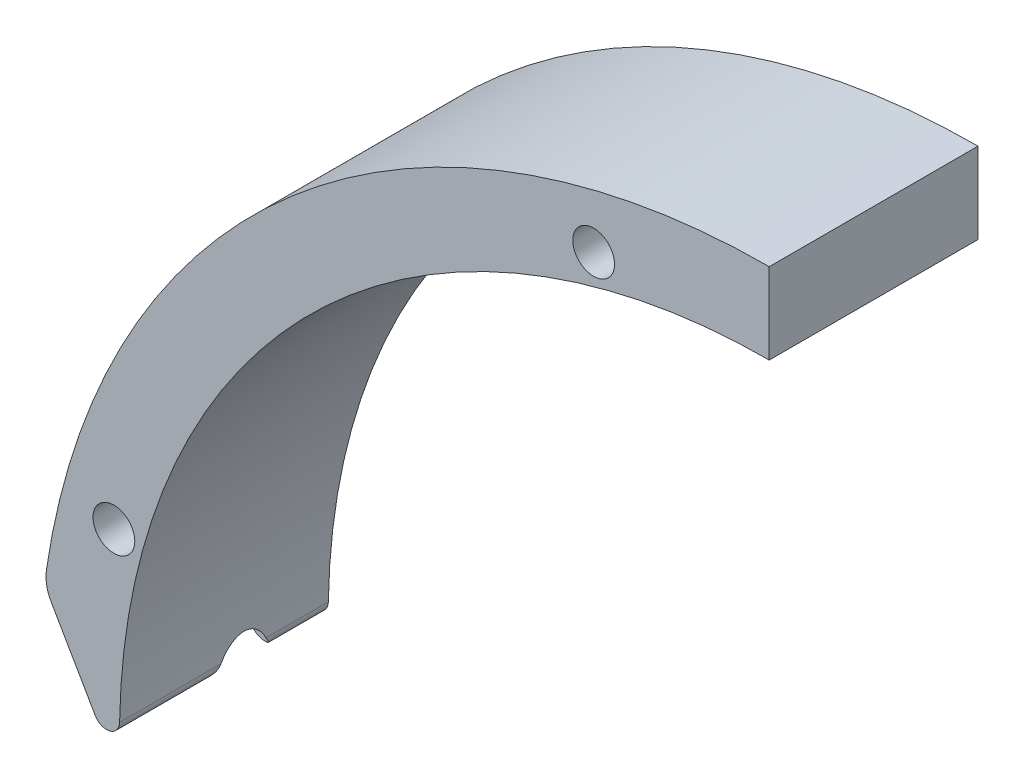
ISO-10303-21;
HEADER;
FILE_DESCRIPTION(('STEP AP214'),'2;1');
FILE_NAME('part.step','',(''),(''),'','','');
FILE_SCHEMA(('AUTOMOTIVE_DESIGN { 1 0 10303 214 1 1 1 1 }'));
ENDSEC;
DATA;
#1=APPLICATION_CONTEXT('core data for automotive mechanical design processes');
#2=APPLICATION_PROTOCOL_DEFINITION('international standard','automotive_design',2000,#1);
#3=PRODUCT_CONTEXT('',#1,'mechanical');
#4=PRODUCT('Part','Part','',(#3));
#5=PRODUCT_RELATED_PRODUCT_CATEGORY('part','',(#4));
#6=PRODUCT_DEFINITION_FORMATION('','',#4);
#7=PRODUCT_DEFINITION_CONTEXT('part definition',#1,'design');
#8=PRODUCT_DEFINITION('design','',#6,#7);
#9=PRODUCT_DEFINITION_SHAPE('','',#8);
#10=(LENGTH_UNIT() NAMED_UNIT(*) SI_UNIT(.MILLI.,.METRE.));
#11=(NAMED_UNIT(*) PLANE_ANGLE_UNIT() SI_UNIT($,.RADIAN.));
#12=(NAMED_UNIT(*) SI_UNIT($,.STERADIAN.) SOLID_ANGLE_UNIT());
#13=UNCERTAINTY_MEASURE_WITH_UNIT(LENGTH_MEASURE(1.E-05),#10,'distance_accuracy_value','');
#14=(GEOMETRIC_REPRESENTATION_CONTEXT(3) GLOBAL_UNCERTAINTY_ASSIGNED_CONTEXT((#13)) GLOBAL_UNIT_ASSIGNED_CONTEXT((#10,
#11,#12)) REPRESENTATION_CONTEXT('',''));
#15=CARTESIAN_POINT('',(0.,0.,0.));
#16=DIRECTION('',(0.,0.,1.));
#17=DIRECTION('',(1.,0.,0.));
#18=AXIS2_PLACEMENT_3D('',#15,#16,#17);
#19=CARTESIAN_POINT('',(-76.8299167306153,43.9738419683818,-4.25404090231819));
#20=DIRECTION('',(0.86602540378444,0.499999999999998,0.));
#21=DIRECTION('',(-0.499999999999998,0.86602540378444,0.));
#22=AXIS2_PLACEMENT_3D('',#19,#20,#21);
#23=PLANE('',#22);
#24=DIRECTION('',(-0.499999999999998,0.86602540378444,0.));
#25=VECTOR('',#24,1.);
#26=CARTESIAN_POINT('',(-76.8299167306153,43.9738419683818,4.));
#27=LINE('',#26,#25);
#28=CARTESIAN_POINT('',(-51.6584782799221,0.375631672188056,4.));
#29=VERTEX_POINT('',#28);
#30=CARTESIAN_POINT('',(-55.0327951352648,6.22011990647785,4.));
#31=VERTEX_POINT('',#30);
#32=EDGE_CURVE('E168',#29,#31,#27,.T.);
#33=ORIENTED_EDGE('',*,*,#32,.T.);
#34=DIRECTION('',(0.,0.,-1.));
#35=VECTOR('',#34,1.);
#36=CARTESIAN_POINT('',(-55.0327951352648,6.22011990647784,-4.25404090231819));
#37=LINE('',#36,#35);
#38=CARTESIAN_POINT('',(-55.0327951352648,6.22011990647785,0.));
#39=VERTEX_POINT('',#38);
#40=EDGE_CURVE('E44',#31,#39,#37,.T.);
#41=ORIENTED_EDGE('',*,*,#40,.T.);
#42=DIRECTION('',(-0.499999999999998,0.86602540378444,0.));
#43=VECTOR('',#42,1.);
#44=CARTESIAN_POINT('',(-38.5812054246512,-22.2748693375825,0.));
#45=LINE('',#44,#43);
#46=CARTESIAN_POINT('',(-51.6584782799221,0.375631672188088,0.));
#47=VERTEX_POINT('',#46);
#48=EDGE_CURVE('E261',#47,#39,#45,.T.);
#49=ORIENTED_EDGE('',*,*,#48,.F.);
#50=DIRECTION('',(0.,0.,-1.));
#51=VECTOR('',#50,1.);
#52=CARTESIAN_POINT('',(-51.6584782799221,0.375631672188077,-4.25404090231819));
#53=LINE('',#52,#51);
#54=EDGE_CURVE('E288',#47,#29,#53,.F.);
#55=ORIENTED_EDGE('',*,*,#54,.T.);
#56=EDGE_LOOP('',(#33,#41,#49,#55));
#57=FACE_BOUND('',#56,.T.);
#58=ADVANCED_FACE('F35',(#57),#23,.F.);
#59=CARTESIAN_POINT('',(0.,0.,16.));
#60=DIRECTION('',(0.,0.,-1.));
#61=DIRECTION('',(-1.,0.,0.));
#62=AXIS2_PLACEMENT_3D('',#59,#60,#61);
#63=CYLINDRICAL_SURFACE('',#62,56.);
#64=CARTESIAN_POINT('',(-55.5362921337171,7.19167963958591,4.));
#65=CARTESIAN_POINT('',(-55.5250639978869,7.27838837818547,4.00000361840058));
#66=CARTESIAN_POINT('',(-55.5136332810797,7.36506300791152,4.00169020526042));
#67=CARTESIAN_POINT('',(-55.4903830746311,7.53823705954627,4.00851878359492));
#68=CARTESIAN_POINT('',(-55.4785635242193,7.62473645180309,4.01366131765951));
#69=CARTESIAN_POINT('',(-55.4424737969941,7.88433003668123,4.03445113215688));
#70=CARTESIAN_POINT('',(-55.4176455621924,8.05695595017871,4.05546183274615));
#71=CARTESIAN_POINT('',(-55.3664122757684,8.40185733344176,4.11317259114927));
#72=CARTESIAN_POINT('',(-55.3399901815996,8.57409503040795,4.15008534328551));
#73=CARTESIAN_POINT('',(-55.2863162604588,8.9136241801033,4.24105722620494));
#74=CARTESIAN_POINT('',(-55.2590658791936,9.08092334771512,4.29508787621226));
#75=CARTESIAN_POINT('',(-55.2045566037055,9.40658894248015,4.42163953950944));
#76=CARTESIAN_POINT('',(-55.1773003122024,9.56502580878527,4.49397771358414));
#77=CARTESIAN_POINT('',(-55.1234983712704,9.87034942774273,4.65948516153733));
#78=CARTESIAN_POINT('',(-55.0969506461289,10.0172731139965,4.75258380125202));
#79=CARTESIAN_POINT('',(-55.0509052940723,10.266971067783,4.94156780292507));
#80=CARTESIAN_POINT('',(-55.0310443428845,10.3727598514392,5.03334647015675));
#81=CARTESIAN_POINT('',(-54.9937500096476,10.5686973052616,5.23287606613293));
#82=CARTESIAN_POINT('',(-54.9763134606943,10.6588664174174,5.34060577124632));
#83=CARTESIAN_POINT('',(-54.9491547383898,10.7978764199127,5.54303670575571));
#84=CARTESIAN_POINT('',(-54.9385910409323,10.8514237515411,5.63437723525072));
#85=CARTESIAN_POINT('',(-54.9203814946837,10.9432121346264,5.82477389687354));
#86=CARTESIAN_POINT('',(-54.9127335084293,10.981464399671,5.92382431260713));
#87=CARTESIAN_POINT('',(-54.9009787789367,11.0400840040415,6.12818893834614));
#88=CARTESIAN_POINT('',(-54.8968991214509,11.0603145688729,6.23354468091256));
#89=CARTESIAN_POINT('',(-54.8928218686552,11.080533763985,6.44625609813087));
#90=CARTESIAN_POINT('',(-54.89282207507,11.0805332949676,6.55361066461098));
#91=CARTESIAN_POINT('',(-54.8966574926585,11.06151231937,6.75397691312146));
#92=CARTESIAN_POINT('',(-54.900050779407,11.0446835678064,6.84721583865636));
#93=CARTESIAN_POINT('',(-54.9097311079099,10.9964552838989,7.02965805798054));
#94=CARTESIAN_POINT('',(-54.9160187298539,10.9650528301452,7.11886053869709));
#95=CARTESIAN_POINT('',(-54.9313246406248,10.8881198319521,7.29479821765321));
#96=CARTESIAN_POINT('',(-54.940439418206,10.8420883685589,7.38130337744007));
#97=CARTESIAN_POINT('',(-54.9607309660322,10.738753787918,7.54697089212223));
#98=CARTESIAN_POINT('',(-54.9719087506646,10.6814451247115,7.62612960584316));
#99=CARTESIAN_POINT('',(-55.0029505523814,10.5207170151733,7.82183452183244));
#100=CARTESIAN_POINT('',(-55.0240087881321,10.4102311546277,7.93239517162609));
#101=CARTESIAN_POINT('',(-55.0683069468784,10.1733063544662,8.13439297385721));
#102=CARTESIAN_POINT('',(-55.0915523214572,10.0468272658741,8.22578040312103));
#103=CARTESIAN_POINT('',(-55.1330335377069,9.81624824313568,8.37012331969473));
#104=CARTESIAN_POINT('',(-55.1510633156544,9.71449311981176,8.42696886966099));
#105=CARTESIAN_POINT('',(-55.1873185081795,9.50636785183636,8.53150143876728));
#106=CARTESIAN_POINT('',(-55.2055440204,9.39999531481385,8.57918363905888));
#107=CARTESIAN_POINT('',(-55.2419620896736,9.18355639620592,8.66614894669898));
#108=CARTESIAN_POINT('',(-55.2601544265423,9.07348085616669,8.70540913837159));
#109=CARTESIAN_POINT('',(-55.296263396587,8.85076189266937,8.77598499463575));
#110=CARTESIAN_POINT('',(-55.314179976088,8.73811797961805,8.80729913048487));
#111=CARTESIAN_POINT('',(-55.350202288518,8.50701217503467,8.8634533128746));
#112=CARTESIAN_POINT('',(-55.3682928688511,8.38848430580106,8.88802983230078));
#113=CARTESIAN_POINT('',(-55.4038959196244,8.15002200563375,8.92969737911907));
#114=CARTESIAN_POINT('',(-55.4214082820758,8.0300873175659,8.94678701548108));
#115=CARTESIAN_POINT('',(-55.4555765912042,7.79060254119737,8.97371612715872));
#116=CARTESIAN_POINT('',(-55.4722396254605,7.67106175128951,8.98363021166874));
#117=CARTESIAN_POINT('',(-55.504830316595,7.43158526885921,8.99676296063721));
#118=CARTESIAN_POINT('',(-55.5207584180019,7.31164986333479,8.99998572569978));
#119=CARTESIAN_POINT('',(-55.5362921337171,7.1916796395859,9.));
#120=B_SPLINE_CURVE_WITH_KNOTS('',3,(#64,#65,#66,#67,#68,#69,#70,#71,#72,#73,#74,#75,#76,#77,
#78,#79,#80,#81,#82,#83,#84,#85,#86,#87,#88,#89,#90,#91,#92,#93,#94,#95,#96,#97,#98,#99,#100,
#101,#102,#103,#104,#105,#106,#107,#108,#109,#110,#111,#112,#113,#114,#115,#116,#117,#118,#119),
.UNSPECIFIED.,.F.,.F.,(4,2,2,2,2,2,2,2,2,2,2,2,2,2,2,2,2,2,2,2,2,2,2,2,2,2,2,4),(0.,
0.262264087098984,0.524569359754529,1.05088011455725,1.58446031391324,2.11715736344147,
2.64473091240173,3.17053614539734,3.59349766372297,4.01590138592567,4.33390570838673,
4.65167645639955,4.97183884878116,5.29182873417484,5.57494500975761,5.85811806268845,
6.1522788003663,6.44658456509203,6.91706892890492,7.38875874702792,7.74212708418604,
8.09568074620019,8.45018453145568,8.80475646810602,9.17168005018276,9.53867177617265,
9.90179056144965,10.2646867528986),.UNSPECIFIED.);
#121=CARTESIAN_POINT('',(-55.4027218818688,8.1571078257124,4.07267014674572));
#122=VERTEX_POINT('',#121);
#123=CARTESIAN_POINT('',(-55.4027218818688,8.15710782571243,8.92732985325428));
#124=VERTEX_POINT('',#123);
#125=EDGE_CURVE('E199',#122,#124,#120,.T.);
#126=ORIENTED_EDGE('',*,*,#125,.T.);
#127=DIRECTION('',(0.,0.,-1.));
#128=VECTOR('',#127,1.);
#129=CARTESIAN_POINT('',(-55.4027218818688,8.15710782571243,16.));
#130=LINE('',#129,#128);
#131=CARTESIAN_POINT('',(-55.4027218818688,8.15710782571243,16.));
#132=VERTEX_POINT('',#131);
#133=EDGE_CURVE('E258',#124,#132,#130,.F.);
#134=ORIENTED_EDGE('',*,*,#133,.T.);
#135=CARTESIAN_POINT('',(0.,0.,16.));
#136=DIRECTION('',(0.,0.,1.));
#137=DIRECTION('',(1.,0.,0.));
#138=AXIS2_PLACEMENT_3D('',#135,#136,#137);
#139=CIRCLE('',#138,56.);
#140=CARTESIAN_POINT('',(0.,56.,16.));
#141=VERTEX_POINT('',#140);
#142=EDGE_CURVE('E139',#141,#132,#139,.T.);
#143=ORIENTED_EDGE('',*,*,#142,.F.);
#144=DIRECTION('',(0.,0.,-1.));
#145=VECTOR('',#144,1.);
#146=CARTESIAN_POINT('',(0.,56.,16.));
#147=LINE('',#146,#145);
#148=CARTESIAN_POINT('',(0.,56.,0.));
#149=VERTEX_POINT('',#148);
#150=EDGE_CURVE('E151',#141,#149,#147,.T.);
#151=ORIENTED_EDGE('',*,*,#150,.T.);
#152=CARTESIAN_POINT('',(0.,0.,0.));
#153=DIRECTION('',(0.,0.,1.));
#154=DIRECTION('',(1.,0.,0.));
#155=AXIS2_PLACEMENT_3D('',#152,#153,#154);
#156=CIRCLE('',#155,56.);
#157=CARTESIAN_POINT('',(-55.4027218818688,8.15710782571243,0.));
#158=VERTEX_POINT('',#157);
#159=EDGE_CURVE('E160',#149,#158,#156,.T.);
#160=ORIENTED_EDGE('',*,*,#159,.T.);
#161=DIRECTION('',(0.,0.,-1.));
#162=VECTOR('',#161,1.);
#163=CARTESIAN_POINT('',(-55.4027218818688,8.15710782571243,16.));
#164=LINE('',#163,#162);
#165=EDGE_CURVE('E260',#158,#122,#164,.F.);
#166=ORIENTED_EDGE('',*,*,#165,.T.);
#167=EDGE_LOOP('',(#126,#134,#143,#151,#160,#166));
#168=FACE_BOUND('',#167,.T.);
#169=ADVANCED_FACE('F245',(#168),#63,.T.);
#170=CARTESIAN_POINT('',(0.,0.,16.));
#171=DIRECTION('',(0.,0.,-1.));
#172=DIRECTION('',(-1.,0.,0.));
#173=AXIS2_PLACEMENT_3D('',#170,#171,#172);
#174=CYLINDRICAL_SURFACE('',#173,49.8);
#175=CARTESIAN_POINT('',(-49.7161222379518,-2.88915032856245,9.));
#176=CARTESIAN_POINT('',(-49.7236886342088,-2.75896416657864,8.9999906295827));
#177=CARTESIAN_POINT('',(-49.7307424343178,-2.62873922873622,8.99794308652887));
#178=CARTESIAN_POINT('',(-49.7438229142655,-2.36834479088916,8.9895125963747));
#179=CARTESIAN_POINT('',(-49.7498493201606,-2.23817531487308,8.98312849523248));
#180=CARTESIAN_POINT('',(-49.7609087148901,-1.97715816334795,8.9657030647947));
#181=CARTESIAN_POINT('',(-49.7659342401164,-1.84631235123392,8.95462854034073));
#182=CARTESIAN_POINT('',(-49.774938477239,-1.58510990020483,8.92747884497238));
#183=CARTESIAN_POINT('',(-49.7789172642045,-1.45475322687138,8.91140403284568));
#184=CARTESIAN_POINT('',(-49.7860667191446,-1.18608748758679,8.87258588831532));
#185=CARTESIAN_POINT('',(-49.7891655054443,-1.0478299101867,8.84946833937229));
#186=CARTESIAN_POINT('',(-49.7941967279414,-0.772600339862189,8.7964612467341));
#187=CARTESIAN_POINT('',(-49.796129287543,-0.63562821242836,8.76657242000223));
#188=CARTESIAN_POINT('',(-49.7988551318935,-0.363911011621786,8.69935419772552));
#189=CARTESIAN_POINT('',(-49.7996516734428,-0.22916067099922,8.66204642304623));
#190=CARTESIAN_POINT('',(-49.8001642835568,0.0376891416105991,8.57900793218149));
#191=CARTESIAN_POINT('',(-49.7998808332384,0.169789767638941,8.53328097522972));
#192=CARTESIAN_POINT('',(-49.7984046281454,0.414822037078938,8.43820689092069));
#193=CARTESIAN_POINT('',(-49.7973237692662,0.528168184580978,8.38993327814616));
#194=CARTESIAN_POINT('',(-49.7944620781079,0.750968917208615,8.28486700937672));
#195=CARTESIAN_POINT('',(-49.7926808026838,0.860420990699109,8.22806897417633));
#196=CARTESIAN_POINT('',(-49.7885675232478,1.07218978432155,8.10567301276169));
#197=CARTESIAN_POINT('',(-49.7862440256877,1.17458791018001,8.04021716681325));
#198=CARTESIAN_POINT('',(-49.7812051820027,1.37159715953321,7.89861666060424));
#199=CARTESIAN_POINT('',(-49.7784904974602,1.46622101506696,7.82249005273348));
#200=CARTESIAN_POINT('',(-49.7735189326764,1.62534355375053,7.67571067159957));
#201=CARTESIAN_POINT('',(-49.7712882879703,1.69195733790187,7.6073683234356));
#202=CARTESIAN_POINT('',(-49.7669139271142,1.81607626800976,7.4625863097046));
#203=CARTESIAN_POINT('',(-49.7647703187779,1.87357035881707,7.38613700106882));
#204=CARTESIAN_POINT('',(-49.7607783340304,1.97677583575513,7.22438849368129));
#205=CARTESIAN_POINT('',(-49.7589332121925,2.02236028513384,7.13900654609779));
#206=CARTESIAN_POINT('',(-49.7558383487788,2.09713496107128,6.9613125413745));
#207=CARTESIAN_POINT('',(-49.7545876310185,2.126352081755,6.86901213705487));
#208=CARTESIAN_POINT('',(-49.752970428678,2.16385640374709,6.68666037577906));
#209=CARTESIAN_POINT('',(-49.7525499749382,2.17342282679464,6.5968774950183));
#210=CARTESIAN_POINT('',(-49.7525093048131,2.17435565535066,6.41722963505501));
#211=CARTESIAN_POINT('',(-49.7528887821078,2.16572902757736,6.32736470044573));
#212=CARTESIAN_POINT('',(-49.754261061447,2.13393901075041,6.16435115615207));
#213=CARTESIAN_POINT('',(-49.7551532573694,2.11315186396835,6.09071803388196));
#214=CARTESIAN_POINT('',(-49.757349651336,2.0607869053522,5.9474398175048));
#215=CARTESIAN_POINT('',(-49.7586539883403,2.02920545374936,5.87779607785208));
#216=CARTESIAN_POINT('',(-49.7622244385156,1.94005513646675,5.71164552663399));
#217=CARTESIAN_POINT('',(-49.7646540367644,1.87725446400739,5.61795865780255));
#218=CARTESIAN_POINT('',(-49.7697248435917,1.73763431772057,5.441677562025));
#219=CARTESIAN_POINT('',(-49.7723665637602,1.6607803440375,5.35911152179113));
#220=CARTESIAN_POINT('',(-49.7770347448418,1.51364197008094,5.22002854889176));
#221=CARTESIAN_POINT('',(-49.7790784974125,1.44512281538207,5.16160588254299));
#222=CARTESIAN_POINT('',(-49.7829950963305,1.30324064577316,5.0509120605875));
#223=CARTESIAN_POINT('',(-49.7848678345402,1.2298746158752,4.99864479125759));
#224=CARTESIAN_POINT('',(-49.7883586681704,1.07935985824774,4.89966589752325));
#225=CARTESIAN_POINT('',(-49.7899763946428,1.00220585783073,4.85296234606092));
#226=CARTESIAN_POINT('',(-49.7928924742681,0.845015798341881,4.7646502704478));
#227=CARTESIAN_POINT('',(-49.7941907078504,0.764978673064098,4.72304365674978));
#228=CARTESIAN_POINT('',(-49.7973508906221,0.53478861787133,4.61158126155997));
#229=CARTESIAN_POINT('',(-49.7987764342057,0.381970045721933,4.54719665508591));
#230=CARTESIAN_POINT('',(-49.8001916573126,0.0714119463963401,4.4315524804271));
#231=CARTESIAN_POINT('',(-49.8001800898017,-0.086331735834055,4.38030434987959));
#232=CARTESIAN_POINT('',(-49.7986055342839,-0.405504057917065,4.28899348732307));
#233=CARTESIAN_POINT('',(-49.7970377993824,-0.566942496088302,4.24896545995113));
#234=CARTESIAN_POINT('',(-49.7922784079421,-0.891857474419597,4.1788853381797));
#235=CARTESIAN_POINT('',(-49.789087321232,-1.05533327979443,4.14882974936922));
#236=CARTESIAN_POINT('',(-49.7816670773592,-1.35827537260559,4.1015289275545));
#237=CARTESIAN_POINT('',(-49.7776740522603,-1.49755444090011,4.0830226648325));
#238=CARTESIAN_POINT('',(-49.7684915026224,-1.77672766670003,4.05181730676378));
#239=CARTESIAN_POINT('',(-49.7633018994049,-1.91662186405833,4.03911859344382));
#240=CARTESIAN_POINT('',(-49.7517844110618,-2.19526325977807,4.0192043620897));
#241=CARTESIAN_POINT('',(-49.7454690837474,-2.3340070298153,4.01193252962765));
#242=CARTESIAN_POINT('',(-49.7316705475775,-2.61156581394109,4.00233721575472));
#243=CARTESIAN_POINT('',(-49.7241877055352,-2.75038079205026,4.00001218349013));
#244=CARTESIAN_POINT('',(-49.7161222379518,-2.88915032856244,4.));
#245=B_SPLINE_CURVE_WITH_KNOTS('',3,(#175,#176,#177,#178,#179,#180,#181,#182,#183,#184,#185,
#186,#187,#188,#189,#190,#191,#192,#193,#194,#195,#196,#197,#198,#199,#200,#201,#202,#203,#204,
#205,#206,#207,#208,#209,#210,#211,#212,#213,#214,#215,#216,#217,#218,#219,#220,#221,#222,#223,
#224,#225,#226,#227,#228,#229,#230,#231,#232,#233,#234,#235,#236,#237,#238,#239,#240,#241,#242,
#243,#244),.UNSPECIFIED.,.F.,.F.,(4,2,2,2,2,2,2,2,2,2,2,2,2,2,2,2,2,2,2,2,2,2,2,2,2,2,2,2,2,2,2,
2,2,2,4),(0.,0.391213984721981,0.782532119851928,1.17666723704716,1.57077408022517,
1.99124990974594,2.41168123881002,2.83090481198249,3.24994165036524,3.61925266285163,
3.9887977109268,4.35289462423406,4.71638284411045,5.00214452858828,5.28825001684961,
5.57729081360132,5.86585526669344,6.13494887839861,6.40393946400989,6.63255587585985,
6.86124945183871,7.19779104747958,7.53517019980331,7.80500376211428,8.07500678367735,
8.34539692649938,8.61588810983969,9.11256741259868,9.60967770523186,10.108309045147,
10.6067654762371,11.0283143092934,11.4498908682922,11.8670294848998,12.2840373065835),.UNSPECIFIED.);
#246=CARTESIAN_POINT('',(-49.792601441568,0.858394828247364,8.22707858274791));
#247=VERTEX_POINT('',#246);
#248=CARTESIAN_POINT('',(-49.792601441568,0.858394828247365,4.77292141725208));
#249=VERTEX_POINT('',#248);
#250=EDGE_CURVE('E170',#247,#249,#245,.T.);
#251=ORIENTED_EDGE('',*,*,#250,.T.);
#252=DIRECTION('',(0.,0.,-1.));
#253=VECTOR('',#252,1.);
#254=CARTESIAN_POINT('',(-49.792601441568,0.858394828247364,16.));
#255=LINE('',#254,#253);
#256=CARTESIAN_POINT('',(-49.792601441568,0.858394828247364,0.));
#257=VERTEX_POINT('',#256);
#258=EDGE_CURVE('E290',#249,#257,#255,.T.);
#259=ORIENTED_EDGE('',*,*,#258,.T.);
#260=CARTESIAN_POINT('',(0.,0.,0.));
#261=DIRECTION('',(0.,0.,-1.));
#262=DIRECTION('',(1.,0.,0.));
#263=AXIS2_PLACEMENT_3D('',#260,#261,#262);
#264=CIRCLE('',#263,49.8);
#265=CARTESIAN_POINT('',(0.,49.8,0.));
#266=VERTEX_POINT('',#265);
#267=EDGE_CURVE('E147',#257,#266,#264,.T.);
#268=ORIENTED_EDGE('',*,*,#267,.T.);
#269=DIRECTION('',(0.,0.,-1.));
#270=VECTOR('',#269,1.);
#271=CARTESIAN_POINT('',(0.,49.8,16.));
#272=LINE('',#271,#270);
#273=CARTESIAN_POINT('',(0.,49.8,16.));
#274=VERTEX_POINT('',#273);
#275=EDGE_CURVE('E142',#274,#266,#272,.T.);
#276=ORIENTED_EDGE('',*,*,#275,.F.);
#277=CARTESIAN_POINT('',(0.,0.,16.));
#278=DIRECTION('',(0.,0.,-1.));
#279=DIRECTION('',(1.,0.,0.));
#280=AXIS2_PLACEMENT_3D('',#277,#278,#279);
#281=CIRCLE('',#280,49.8);
#282=CARTESIAN_POINT('',(-49.792601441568,0.858394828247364,16.));
#283=VERTEX_POINT('',#282);
#284=EDGE_CURVE('E125',#283,#274,#281,.T.);
#285=ORIENTED_EDGE('',*,*,#284,.F.);
#286=DIRECTION('',(0.,0.,-1.));
#287=VECTOR('',#286,1.);
#288=CARTESIAN_POINT('',(-49.792601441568,0.858394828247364,16.));
#289=LINE('',#288,#287);
#290=EDGE_CURVE('E177',#283,#247,#289,.T.);
#291=ORIENTED_EDGE('',*,*,#290,.T.);
#292=EDGE_LOOP('',(#251,#259,#268,#276,#285,#291));
#293=FACE_BOUND('',#292,.T.);
#294=ADVANCED_FACE('F144',(#293),#174,.F.);
#295=CARTESIAN_POINT('',(0.,56.,16.));
#296=DIRECTION('',(-1.,0.,0.));
#297=DIRECTION('',(0.,-1.,0.));
#298=AXIS2_PLACEMENT_3D('',#295,#296,#297);
#299=PLANE('',#298);
#300=DIRECTION('',(0.,1.,0.));
#301=VECTOR('',#300,1.);
#302=CARTESIAN_POINT('',(0.,56.,0.));
#303=LINE('',#302,#301);
#304=EDGE_CURVE('E165',#266,#149,#303,.T.);
#305=ORIENTED_EDGE('',*,*,#304,.T.);
#306=ORIENTED_EDGE('',*,*,#150,.F.);
#307=DIRECTION('',(0.,1.,0.));
#308=VECTOR('',#307,1.);
#309=CARTESIAN_POINT('',(0.,56.,16.));
#310=LINE('',#309,#308);
#311=EDGE_CURVE('E131',#274,#141,#310,.T.);
#312=ORIENTED_EDGE('',*,*,#311,.F.);
#313=ORIENTED_EDGE('',*,*,#275,.T.);
#314=EDGE_LOOP('',(#305,#306,#312,#313));
#315=FACE_BOUND('',#314,.T.);
#316=ADVANCED_FACE('F153',(#315),#299,.F.);
#317=CARTESIAN_POINT('',(0.,0.,16.));
#318=DIRECTION('',(0.,0.,1.));
#319=DIRECTION('',(1.,0.,0.));
#320=AXIS2_PLACEMENT_3D('',#317,#318,#319);
#321=PLANE('',#320);
#322=ORIENTED_EDGE('',*,*,#142,.T.);
#323=CARTESIAN_POINT('',(-52.4347189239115,7.72011990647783,16.));
#324=DIRECTION('',(0.,0.,1.));
#325=DIRECTION('',(1.,0.,0.));
#326=AXIS2_PLACEMENT_3D('',#323,#324,#325);
#327=CIRCLE('',#326,3.);
#328=CARTESIAN_POINT('',(-55.0327951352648,6.22011990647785,16.));
#329=VERTEX_POINT('',#328);
#330=EDGE_CURVE('E266',#132,#329,#327,.T.);
#331=ORIENTED_EDGE('',*,*,#330,.T.);
#332=DIRECTION('',(-0.499999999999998,0.86602540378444,0.));
#333=VECTOR('',#332,1.);
#334=CARTESIAN_POINT('',(-38.5812054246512,-22.2748693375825,16.));
#335=LINE('',#334,#333);
#336=CARTESIAN_POINT('',(-51.6584782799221,0.375631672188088,16.));
#337=VERTEX_POINT('',#336);
#338=EDGE_CURVE('E295',#337,#329,#335,.T.);
#339=ORIENTED_EDGE('',*,*,#338,.F.);
#340=CARTESIAN_POINT('',(-50.7924528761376,0.875631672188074,16.));
#341=DIRECTION('',(0.,0.,1.));
#342=DIRECTION('',(1.,0.,0.));
#343=AXIS2_PLACEMENT_3D('',#340,#341,#342);
#344=CIRCLE('',#343,1.);
#345=EDGE_CURVE('E135',#337,#283,#344,.T.);
#346=ORIENTED_EDGE('',*,*,#345,.T.);
#347=ORIENTED_EDGE('',*,*,#284,.T.);
#348=ORIENTED_EDGE('',*,*,#311,.T.);
#349=EDGE_LOOP('',(#322,#331,#339,#346,#347,#348));
#350=FACE_BOUND('',#349,.T.);
#351=CARTESIAN_POINT('',(-13.4585903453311,50.2281429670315,16.));
#352=DIRECTION('',(0.,0.,1.));
#353=DIRECTION('',(1.,0.,0.));
#354=AXIS2_PLACEMENT_3D('',#351,#352,#353);
#355=CIRCLE('',#354,1.59999999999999);
#356=CARTESIAN_POINT('',(-11.8585903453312,50.2281429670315,16.));
#357=VERTEX_POINT('',#356);
#358=EDGE_CURVE('E296',#357,#357,#355,.T.);
#359=ORIENTED_EDGE('',*,*,#358,.F.);
#360=EDGE_LOOP('',(#359));
#361=FACE_BOUND('',#360,.T.);
#362=CARTESIAN_POINT('',(-50.2281429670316,13.4585903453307,16.));
#363=DIRECTION('',(0.,0.,1.));
#364=DIRECTION('',(1.,0.,0.));
#365=AXIS2_PLACEMENT_3D('',#362,#363,#364);
#366=CIRCLE('',#365,1.59999999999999);
#367=CARTESIAN_POINT('',(-48.6281429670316,13.4585903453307,16.));
#368=VERTEX_POINT('',#367);
#369=EDGE_CURVE('E308',#368,#368,#366,.T.);
#370=ORIENTED_EDGE('',*,*,#369,.F.);
#371=EDGE_LOOP('',(#370));
#372=FACE_BOUND('',#371,.T.);
#373=ADVANCED_FACE('F128',(#350,#361,#372),#321,.T.);
#374=CARTESIAN_POINT('',(0.,0.,0.));
#375=DIRECTION('',(0.,0.,1.));
#376=DIRECTION('',(1.,0.,0.));
#377=AXIS2_PLACEMENT_3D('',#374,#375,#376);
#378=PLANE('',#377);
#379=CARTESIAN_POINT('',(-13.4585903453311,50.2281429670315,0.));
#380=DIRECTION('',(0.,0.,1.));
#381=DIRECTION('',(1.,0.,0.));
#382=AXIS2_PLACEMENT_3D('',#379,#380,#381);
#383=CIRCLE('',#382,1.6);
#384=CARTESIAN_POINT('',(-11.8585903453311,50.2281429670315,0.));
#385=VERTEX_POINT('',#384);
#386=EDGE_CURVE('E311',#385,#385,#383,.T.);
#387=ORIENTED_EDGE('',*,*,#386,.T.);
#388=EDGE_LOOP('',(#387));
#389=FACE_BOUND('',#388,.T.);
#390=CARTESIAN_POINT('',(-50.2281429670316,13.4585903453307,0.));
#391=DIRECTION('',(0.,0.,1.));
#392=DIRECTION('',(1.,0.,0.));
#393=AXIS2_PLACEMENT_3D('',#390,#391,#392);
#394=CIRCLE('',#393,1.6);
#395=CARTESIAN_POINT('',(-48.6281429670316,13.4585903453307,0.));
#396=VERTEX_POINT('',#395);
#397=EDGE_CURVE('E163',#396,#396,#394,.T.);
#398=ORIENTED_EDGE('',*,*,#397,.T.);
#399=EDGE_LOOP('',(#398));
#400=FACE_BOUND('',#399,.T.);
#401=ORIENTED_EDGE('',*,*,#48,.T.);
#402=CARTESIAN_POINT('',(-52.4347189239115,7.72011990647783,0.));
#403=DIRECTION('',(0.,0.,1.));
#404=DIRECTION('',(1.,0.,0.));
#405=AXIS2_PLACEMENT_3D('',#402,#403,#404);
#406=CIRCLE('',#405,3.);
#407=EDGE_CURVE('E11',#39,#158,#406,.F.);
#408=ORIENTED_EDGE('',*,*,#407,.T.);
#409=ORIENTED_EDGE('',*,*,#159,.F.);
#410=ORIENTED_EDGE('',*,*,#304,.F.);
#411=ORIENTED_EDGE('',*,*,#267,.F.);
#412=CARTESIAN_POINT('',(-50.7924528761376,0.875631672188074,0.));
#413=DIRECTION('',(0.,0.,1.));
#414=DIRECTION('',(1.,0.,0.));
#415=AXIS2_PLACEMENT_3D('',#412,#413,#414);
#416=CIRCLE('',#415,1.);
#417=EDGE_CURVE('E298',#257,#47,#416,.F.);
#418=ORIENTED_EDGE('',*,*,#417,.T.);
#419=EDGE_LOOP('',(#401,#408,#409,#410,#411,#418));
#420=FACE_BOUND('',#419,.T.);
#421=ADVANCED_FACE('F302',(#389,#400,#420),#378,.F.);
#422=CARTESIAN_POINT('',(-50.2281429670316,13.4585903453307,16.));
#423=DIRECTION('',(0.,0.,1.));
#424=DIRECTION('',(1.,0.,0.));
#425=AXIS2_PLACEMENT_3D('',#422,#423,#424);
#426=CYLINDRICAL_SURFACE('',#425,1.59999999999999);
#427=ORIENTED_EDGE('',*,*,#397,.F.);
#428=EDGE_LOOP('',(#427));
#429=FACE_BOUND('',#428,.T.);
#430=ORIENTED_EDGE('',*,*,#369,.T.);
#431=EDGE_LOOP('',(#430));
#432=FACE_BOUND('',#431,.T.);
#433=ADVANCED_FACE('F323',(#429,#432),#426,.F.);
#434=CARTESIAN_POINT('',(-13.4585903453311,50.2281429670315,16.));
#435=DIRECTION('',(0.,0.,1.));
#436=DIRECTION('',(1.,0.,0.));
#437=AXIS2_PLACEMENT_3D('',#434,#435,#436);
#438=CYLINDRICAL_SURFACE('',#437,1.59999999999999);
#439=ORIENTED_EDGE('',*,*,#386,.F.);
#440=EDGE_LOOP('',(#439));
#441=FACE_BOUND('',#440,.T.);
#442=ORIENTED_EDGE('',*,*,#358,.T.);
#443=EDGE_LOOP('',(#442));
#444=FACE_BOUND('',#443,.T.);
#445=ADVANCED_FACE('F317',(#441,#444),#438,.F.);
#446=ORIENTED_EDGE('',*,*,#338,.T.);
#447=DIRECTION('',(0.,0.,-1.));
#448=VECTOR('',#447,1.);
#449=CARTESIAN_POINT('',(-55.0327951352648,6.22011990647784,-4.25404090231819));
#450=LINE('',#449,#448);
#451=CARTESIAN_POINT('',(-55.0327951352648,6.22011990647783,9.));
#452=VERTEX_POINT('',#451);
#453=EDGE_CURVE('E268',#329,#452,#450,.T.);
#454=ORIENTED_EDGE('',*,*,#453,.T.);
#455=DIRECTION('',(0.499999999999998,-0.86602540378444,0.));
#456=VECTOR('',#455,1.);
#457=CARTESIAN_POINT('',(-76.8299167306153,43.9738419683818,9.00000000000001));
#458=LINE('',#457,#456);
#459=CARTESIAN_POINT('',(-51.6584782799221,0.375631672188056,9.));
#460=VERTEX_POINT('',#459);
#461=EDGE_CURVE('E150',#452,#460,#458,.T.);
#462=ORIENTED_EDGE('',*,*,#461,.T.);
#463=DIRECTION('',(0.,0.,-1.));
#464=VECTOR('',#463,1.);
#465=CARTESIAN_POINT('',(-51.6584782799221,0.375631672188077,-4.25404090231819));
#466=LINE('',#465,#464);
#467=EDGE_CURVE('E292',#460,#337,#466,.F.);
#468=ORIENTED_EDGE('',*,*,#467,.T.);
#469=EDGE_LOOP('',(#446,#454,#462,#468));
#470=FACE_BOUND('',#469,.T.);
#471=ADVANCED_FACE('F188',(#470),#23,.F.);
#472=CARTESIAN_POINT('',(-76.6735329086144,43.8024545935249,6.5));
#473=DIRECTION('',(0.499999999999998,-0.86602540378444,0.));
#474=DIRECTION('',(0.86602540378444,0.499999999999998,0.));
#475=AXIS2_PLACEMENT_3D('',#472,#473,#474);
#476=CYLINDRICAL_SURFACE('',#475,2.5);
#477=DIRECTION('',(0.499999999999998,-0.86602540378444,0.));
#478=VECTOR('',#477,1.);
#479=CARTESIAN_POINT('',(-76.6735329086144,43.8024545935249,9.00000000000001));
#480=LINE('',#479,#478);
#481=CARTESIAN_POINT('',(-55.2617303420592,6.71612466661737,9.));
#482=VERTEX_POINT('',#481);
#483=CARTESIAN_POINT('',(-51.4596764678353,0.130774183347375,9.));
#484=VERTEX_POINT('',#483);
#485=EDGE_CURVE('E278',#482,#484,#480,.T.);
#486=ORIENTED_EDGE('',*,*,#485,.F.);
#487=CARTESIAN_POINT('',(-55.2617303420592,6.71612466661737,9.));
#488=CARTESIAN_POINT('',(-55.2892730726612,6.79365188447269,8.99997477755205));
#489=CARTESIAN_POINT('',(-55.3136112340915,6.87232127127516,8.99986592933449));
#490=CARTESIAN_POINT('',(-55.3557618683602,7.0314449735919,8.99893721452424));
#491=CARTESIAN_POINT('',(-55.3735696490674,7.11190052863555,8.99811683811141));
#492=CARTESIAN_POINT('',(-55.4021906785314,7.27223426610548,8.99525105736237));
#493=CARTESIAN_POINT('',(-55.4131466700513,7.35208739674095,8.99323249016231));
#494=CARTESIAN_POINT('',(-55.4285938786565,7.5123048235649,8.98733161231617));
#495=CARTESIAN_POINT('',(-55.433088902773,7.59266879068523,8.98345040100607));
#496=CARTESIAN_POINT('',(-55.4356160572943,7.75379363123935,8.97304867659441));
#497=CARTESIAN_POINT('',(-55.4336117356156,7.83455419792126,8.9665134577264));
#498=CARTESIAN_POINT('',(-55.4231057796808,7.99617722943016,8.94986213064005));
#499=CARTESIAN_POINT('',(-55.4145327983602,8.07703101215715,8.93970735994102));
#500=CARTESIAN_POINT('',(-55.4027218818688,8.15710782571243,8.92732985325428));
#501=B_SPLINE_CURVE_WITH_KNOTS('',3,(#487,#488,#489,#490,#491,#492,#493,#494,#495,#496,#497,
#498,#499,#500),.UNSPECIFIED.,.F.,.F.,(4,2,2,2,2,2,4),(0.,0.246759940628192,0.493696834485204,
0.735301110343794,0.976762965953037,1.21958141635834,1.46507535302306),.UNSPECIFIED.);
#502=EDGE_CURVE('E226',#482,#124,#501,.T.);
#503=ORIENTED_EDGE('',*,*,#502,.T.);
#504=ORIENTED_EDGE('',*,*,#125,.F.);
#505=CARTESIAN_POINT('',(-55.4027218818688,8.1571078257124,4.07267014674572));
#506=CARTESIAN_POINT('',(-55.4143681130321,8.07814450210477,4.06046431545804));
#507=CARTESIAN_POINT('',(-55.4228665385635,7.99842379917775,4.05042018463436));
#508=CARTESIAN_POINT('',(-55.4334615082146,7.83823218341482,4.03381652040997));
#509=CARTESIAN_POINT('',(-55.4355612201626,7.75776166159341,4.02725526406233));
#510=CARTESIAN_POINT('',(-55.4332875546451,7.59839028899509,4.01687462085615));
#511=CARTESIAN_POINT('',(-55.4290447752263,7.51949075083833,4.01300225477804));
#512=CARTESIAN_POINT('',(-55.4143407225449,7.36222468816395,4.00707891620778));
#513=CARTESIAN_POINT('',(-55.4038806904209,7.28385806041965,4.00502758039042));
#514=CARTESIAN_POINT('',(-55.3759378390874,7.12321909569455,4.00202075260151));
#515=CARTESIAN_POINT('',(-55.3580503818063,7.04101566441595,4.00114332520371));
#516=CARTESIAN_POINT('',(-55.315209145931,6.8774964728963,4.00014291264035));
#517=CARTESIAN_POINT('',(-55.2901796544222,6.79620048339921,4.00002834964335));
#518=CARTESIAN_POINT('',(-55.2617303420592,6.71612466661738,4.));
#519=B_SPLINE_CURVE_WITH_KNOTS('',3,(#505,#506,#507,#508,#509,#510,#511,#512,#513,#514,#515,
#516,#517,#518),.UNSPECIFIED.,.F.,.F.,(4,2,2,2,2,2,4),(0.,0.242087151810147,0.484054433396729,
0.721107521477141,0.958113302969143,1.21020511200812,1.46507551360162),.UNSPECIFIED.);
#520=CARTESIAN_POINT('',(-55.2617303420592,6.71612466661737,4.));
#521=VERTEX_POINT('',#520);
#522=EDGE_CURVE('E221',#122,#521,#519,.T.);
#523=ORIENTED_EDGE('',*,*,#522,.T.);
#524=DIRECTION('',(0.499999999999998,-0.86602540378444,0.));
#525=VECTOR('',#524,1.);
#526=CARTESIAN_POINT('',(-76.6735329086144,43.8024545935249,4.));
#527=LINE('',#526,#525);
#528=CARTESIAN_POINT('',(-51.4596764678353,0.13077418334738,4.));
#529=VERTEX_POINT('',#528);
#530=EDGE_CURVE('E262',#521,#529,#527,.T.);
#531=ORIENTED_EDGE('',*,*,#530,.T.);
#532=CARTESIAN_POINT('',(-51.4596764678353,0.13077418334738,4.));
#533=CARTESIAN_POINT('',(-51.4389822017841,0.112237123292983,4.00000209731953));
#534=CARTESIAN_POINT('',(-51.4175248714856,0.0945713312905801,4.00004482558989));
#535=CARTESIAN_POINT('',(-51.3732156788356,0.0610847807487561,4.00029665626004));
#536=CARTESIAN_POINT('',(-51.3503637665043,0.045264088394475,4.00050576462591));
#537=CARTESIAN_POINT('',(-51.2799372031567,0.00073880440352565,4.00151003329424));
#538=CARTESIAN_POINT('',(-51.2304726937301,-0.0250460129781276,4.00268198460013));
#539=CARTESIAN_POINT('',(-51.1279754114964,-0.0680420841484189,4.0068405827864));
#540=CARTESIAN_POINT('',(-51.0749387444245,-0.0852438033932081,4.00982923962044));
#541=CARTESIAN_POINT('',(-50.9669782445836,-0.110578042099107,4.0184678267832));
#542=CARTESIAN_POINT('',(-50.9120559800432,-0.118717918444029,4.0241155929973));
#543=CARTESIAN_POINT('',(-50.8031850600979,-0.125767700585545,4.03865266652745));
#544=CARTESIAN_POINT('',(-50.7492391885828,-0.124861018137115,4.04747407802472));
#545=CARTESIAN_POINT('',(-50.6429078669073,-0.114564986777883,4.0688207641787));
#546=CARTESIAN_POINT('',(-50.5905226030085,-0.10517462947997,4.0813464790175));
#547=CARTESIAN_POINT('',(-50.4896241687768,-0.0788188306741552,4.11001307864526));
#548=CARTESIAN_POINT('',(-50.4410658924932,-0.0619651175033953,4.12609895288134));
#549=CARTESIAN_POINT('',(-50.3481749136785,-0.0216876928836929,4.16179120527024));
#550=CARTESIAN_POINT('',(-50.3038425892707,0.00173660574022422,4.18139789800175));
#551=CARTESIAN_POINT('',(-50.2177473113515,0.0556058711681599,4.22494641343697));
#552=CARTESIAN_POINT('',(-50.1762875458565,0.08638202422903,4.24907504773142));
#553=CARTESIAN_POINT('',(-50.099497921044,0.152861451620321,4.30012686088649));
#554=CARTESIAN_POINT('',(-50.0641719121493,0.188567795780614,4.32705177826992));
#555=CARTESIAN_POINT('',(-49.9952898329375,0.2692232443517,4.38690612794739));
#556=CARTESIAN_POINT('',(-49.9626996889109,0.314764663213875,4.42014496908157));
#557=CARTESIAN_POINT('',(-49.9058425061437,0.409806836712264,4.48809822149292));
#558=CARTESIAN_POINT('',(-49.8815804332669,0.459309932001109,4.52281349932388));
#559=CARTESIAN_POINT('',(-49.8508192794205,0.537716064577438,4.57615939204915));
#560=CARTESIAN_POINT('',(-49.8413064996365,0.56549418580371,4.59476297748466));
#561=CARTESIAN_POINT('',(-49.8247298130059,0.62190740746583,4.63176415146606));
#562=CARTESIAN_POINT('',(-49.8176655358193,0.650542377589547,4.65016177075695));
#563=CARTESIAN_POINT('',(-49.8060581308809,0.708592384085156,4.68646178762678));
#564=CARTESIAN_POINT('',(-49.8015126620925,0.738006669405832,4.70436463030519));
#565=CARTESIAN_POINT('',(-49.7950515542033,0.797622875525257,4.73935010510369));
#566=CARTESIAN_POINT('',(-49.7931375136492,0.827825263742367,4.75643223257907));
#567=CARTESIAN_POINT('',(-49.792601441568,0.858394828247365,4.77292141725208));
#568=B_SPLINE_CURVE_WITH_KNOTS('',3,(#532,#533,#534,#535,#536,#537,#538,#539,#540,#541,#542,
#543,#544,#545,#546,#547,#548,#549,#550,#551,#552,#553,#554,#555,#556,#557,#558,#559,#560,#561,
#562,#563,#564,#565,#566,#567),.UNSPECIFIED.,.F.,.F.,(4,2,2,2,2,2,2,2,2,2,2,2,2,2,2,2,2,4),(0.,
0.083297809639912,0.166598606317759,0.333124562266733,0.499835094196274,0.666410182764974,
0.829615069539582,0.992839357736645,1.1536986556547,1.31457233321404,1.48488123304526,
1.65529665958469,1.84994399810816,2.04470720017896,2.14890447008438,2.25308597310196,
2.35717048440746,2.46131819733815),.UNSPECIFIED.);
#569=EDGE_CURVE('E214',#529,#249,#568,.T.);
#570=ORIENTED_EDGE('',*,*,#569,.T.);
#571=ORIENTED_EDGE('',*,*,#250,.F.);
#572=CARTESIAN_POINT('',(-49.792601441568,0.858394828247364,8.22707858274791));
#573=CARTESIAN_POINT('',(-49.7932693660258,0.820819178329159,8.24736098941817));
#574=CARTESIAN_POINT('',(-49.7960064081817,0.783798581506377,8.26851884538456));
#575=CARTESIAN_POINT('',(-49.8054164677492,0.710958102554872,8.31195447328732));
#576=CARTESIAN_POINT('',(-49.8120870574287,0.675137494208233,8.33423154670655));
#577=CARTESIAN_POINT('',(-49.8291994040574,0.604592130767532,8.37939653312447));
#578=CARTESIAN_POINT('',(-49.8396570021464,0.569872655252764,8.40228663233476));
#579=CARTESIAN_POINT('',(-49.8642473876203,0.501807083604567,8.44812233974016));
#580=CARTESIAN_POINT('',(-49.8783805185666,0.468461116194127,8.47106795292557));
#581=CARTESIAN_POINT('',(-49.9223150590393,0.37873249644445,8.53377958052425));
#582=CARTESIAN_POINT('',(-49.9559025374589,0.323903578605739,8.57320562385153));
#583=CARTESIAN_POINT('',(-50.0341453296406,0.220534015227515,8.6489649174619));
#584=CARTESIAN_POINT('',(-50.0787730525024,0.171978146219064,8.68530557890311));
#585=CARTESIAN_POINT('',(-50.1686569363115,0.0922273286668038,8.74636331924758));
#586=CARTESIAN_POINT('',(-50.211968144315,0.0595063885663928,8.77194600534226));
#587=CARTESIAN_POINT('',(-50.3048511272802,0.000842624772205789,8.81928260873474));
#588=CARTESIAN_POINT('',(-50.3544197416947,-0.0251036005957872,8.84103844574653));
#589=CARTESIAN_POINT('',(-50.4589784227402,-0.0688365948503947,8.88023962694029));
#590=CARTESIAN_POINT('',(-50.5139950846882,-0.086580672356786,8.89766220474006));
#591=CARTESIAN_POINT('',(-50.6274839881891,-0.112379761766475,8.92783199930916));
#592=CARTESIAN_POINT('',(-50.6859551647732,-0.120437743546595,8.94058064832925));
#593=CARTESIAN_POINT('',(-50.7987666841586,-0.125795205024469,8.96072714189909));
#594=CARTESIAN_POINT('',(-50.8529979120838,-0.124008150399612,8.96850671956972));
#595=CARTESIAN_POINT('',(-50.9608070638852,-0.111586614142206,8.9809898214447));
#596=CARTESIAN_POINT('',(-51.0143848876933,-0.100950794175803,8.98569288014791));
#597=CARTESIAN_POINT('',(-51.1185170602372,-0.0712464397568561,8.99271105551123));
#598=CARTESIAN_POINT('',(-51.1691021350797,-0.0522918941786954,8.99505708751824));
#599=CARTESIAN_POINT('',(-51.2665671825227,-0.00647276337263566,8.99824452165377));
#600=CARTESIAN_POINT('',(-51.3134510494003,0.0203833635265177,8.99908752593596));
#601=CARTESIAN_POINT('',(-51.3756642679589,0.0630221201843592,8.99971487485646));
#602=CARTESIAN_POINT('',(-51.3930958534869,0.0758215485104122,8.9998308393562));
#603=CARTESIAN_POINT('',(-51.4270622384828,0.10249816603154,8.99997298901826));
#604=CARTESIAN_POINT('',(-51.4435986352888,0.116373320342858,8.9999993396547));
#605=CARTESIAN_POINT('',(-51.4596764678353,0.130774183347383,9.));
#606=B_SPLINE_CURVE_WITH_KNOTS('',3,(#572,#573,#574,#575,#576,#577,#578,#579,#580,#581,#582,
#583,#584,#585,#586,#587,#588,#589,#590,#591,#592,#593,#594,#595,#596,#597,#598,#599,#600,#601,
#602,#603,#604,#605),.UNSPECIFIED.,.F.,.F.,(4,2,2,2,2,2,2,2,2,2,2,2,2,2,2,2,4),(0.,
0.127995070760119,0.25591122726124,0.384368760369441,0.512838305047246,0.738011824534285,
0.962628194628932,1.1419079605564,1.32109753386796,1.50120955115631,1.68126632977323,
1.84491526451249,2.00858895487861,2.17008667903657,2.33141215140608,2.39625507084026,
2.46097819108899),.UNSPECIFIED.);
#607=EDGE_CURVE('E207',#247,#484,#606,.T.);
#608=ORIENTED_EDGE('',*,*,#607,.T.);
#609=EDGE_LOOP('',(#486,#503,#504,#523,#531,#570,#571,#608));
#610=FACE_BOUND('',#609,.T.);
#611=ADVANCED_FACE('F182',(#610),#476,.F.);
#612=CARTESIAN_POINT('',(-76.6735329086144,43.8024545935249,4.));
#613=DIRECTION('',(0.,0.,-1.));
#614=DIRECTION('',(-1.,0.,0.));
#615=AXIS2_PLACEMENT_3D('',#612,#613,#614);
#616=PLANE('',#615);
#617=ORIENTED_EDGE('',*,*,#530,.F.);
#618=CARTESIAN_POINT('',(-52.4347189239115,7.72011990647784,4.));
#619=DIRECTION('',(0.,0.,-1.));
#620=DIRECTION('',(-1.,0.,0.));
#621=AXIS2_PLACEMENT_3D('',#618,#619,#620);
#622=CIRCLE('',#621,3.);
#623=EDGE_CURVE('E58',#521,#31,#622,.F.);
#624=ORIENTED_EDGE('',*,*,#623,.T.);
#625=ORIENTED_EDGE('',*,*,#32,.F.);
#626=CARTESIAN_POINT('',(-50.7924528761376,0.875631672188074,4.));
#627=DIRECTION('',(0.,0.,-1.));
#628=DIRECTION('',(-1.,0.,0.));
#629=AXIS2_PLACEMENT_3D('',#626,#627,#628);
#630=CIRCLE('',#629,1.);
#631=EDGE_CURVE('E286',#29,#529,#630,.F.);
#632=ORIENTED_EDGE('',*,*,#631,.T.);
#633=EDGE_LOOP('',(#617,#624,#625,#632));
#634=FACE_BOUND('',#633,.T.);
#635=ADVANCED_FACE('F187',(#634),#616,.F.);
#636=CARTESIAN_POINT('',(-87.0658377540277,37.8024545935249,9.));
#637=DIRECTION('',(0.,0.,1.));
#638=DIRECTION('',(1.,0.,0.));
#639=AXIS2_PLACEMENT_3D('',#636,#637,#638);
#640=PLANE('',#639);
#641=ORIENTED_EDGE('',*,*,#461,.F.);
#642=CARTESIAN_POINT('',(-52.4347189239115,7.72011990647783,9.));
#643=DIRECTION('',(0.,0.,1.));
#644=DIRECTION('',(1.,0.,0.));
#645=AXIS2_PLACEMENT_3D('',#642,#643,#644);
#646=CIRCLE('',#645,3.);
#647=EDGE_CURVE('E227',#452,#482,#646,.F.);
#648=ORIENTED_EDGE('',*,*,#647,.T.);
#649=ORIENTED_EDGE('',*,*,#485,.T.);
#650=CARTESIAN_POINT('',(-50.7924528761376,0.875631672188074,9.));
#651=DIRECTION('',(0.,0.,1.));
#652=DIRECTION('',(1.,0.,0.));
#653=AXIS2_PLACEMENT_3D('',#650,#651,#652);
#654=CIRCLE('',#653,1.);
#655=EDGE_CURVE('E291',#484,#460,#654,.F.);
#656=ORIENTED_EDGE('',*,*,#655,.T.);
#657=EDGE_LOOP('',(#641,#648,#649,#656));
#658=FACE_BOUND('',#657,.T.);
#659=ADVANCED_FACE('F190',(#658),#640,.F.);
#660=CARTESIAN_POINT('',(-50.7924528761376,0.875631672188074,16.));
#661=DIRECTION('',(0.,0.,-1.));
#662=DIRECTION('',(-1.,0.,0.));
#663=AXIS2_PLACEMENT_3D('',#660,#661,#662);
#664=CYLINDRICAL_SURFACE('',#663,1.);
#665=ORIENTED_EDGE('',*,*,#631,.F.);
#666=ORIENTED_EDGE('',*,*,#54,.F.);
#667=ORIENTED_EDGE('',*,*,#417,.F.);
#668=ORIENTED_EDGE('',*,*,#258,.F.);
#669=ORIENTED_EDGE('',*,*,#569,.F.);
#670=EDGE_LOOP('',(#665,#666,#667,#668,#669));
#671=FACE_BOUND('',#670,.T.);
#672=ADVANCED_FACE('F240',(#671),#664,.T.);
#673=CARTESIAN_POINT('',(-50.7924528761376,0.875631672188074,16.));
#674=DIRECTION('',(0.,0.,-1.));
#675=DIRECTION('',(-1.,0.,0.));
#676=AXIS2_PLACEMENT_3D('',#673,#674,#675);
#677=CYLINDRICAL_SURFACE('',#676,1.);
#678=ORIENTED_EDGE('',*,*,#345,.F.);
#679=ORIENTED_EDGE('',*,*,#467,.F.);
#680=ORIENTED_EDGE('',*,*,#655,.F.);
#681=ORIENTED_EDGE('',*,*,#607,.F.);
#682=ORIENTED_EDGE('',*,*,#290,.F.);
#683=EDGE_LOOP('',(#678,#679,#680,#681,#682));
#684=FACE_BOUND('',#683,.T.);
#685=ADVANCED_FACE('F236',(#684),#677,.T.);
#686=CARTESIAN_POINT('',(-52.4347189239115,7.72011990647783,16.));
#687=DIRECTION('',(0.,0.,-1.));
#688=DIRECTION('',(-1.,0.,0.));
#689=AXIS2_PLACEMENT_3D('',#686,#687,#688);
#690=CYLINDRICAL_SURFACE('',#689,3.);
#691=ORIENTED_EDGE('',*,*,#647,.F.);
#692=ORIENTED_EDGE('',*,*,#453,.F.);
#693=ORIENTED_EDGE('',*,*,#330,.F.);
#694=ORIENTED_EDGE('',*,*,#133,.F.);
#695=ORIENTED_EDGE('',*,*,#502,.F.);
#696=EDGE_LOOP('',(#691,#692,#693,#694,#695));
#697=FACE_BOUND('',#696,.T.);
#698=ADVANCED_FACE('F233',(#697),#690,.T.);
#699=CARTESIAN_POINT('',(-52.4347189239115,7.72011990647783,16.));
#700=DIRECTION('',(0.,0.,-1.));
#701=DIRECTION('',(-1.,0.,0.));
#702=AXIS2_PLACEMENT_3D('',#699,#700,#701);
#703=CYLINDRICAL_SURFACE('',#702,3.);
#704=ORIENTED_EDGE('',*,*,#407,.F.);
#705=ORIENTED_EDGE('',*,*,#40,.F.);
#706=ORIENTED_EDGE('',*,*,#623,.F.);
#707=ORIENTED_EDGE('',*,*,#522,.F.);
#708=ORIENTED_EDGE('',*,*,#165,.F.);
#709=EDGE_LOOP('',(#704,#705,#706,#707,#708));
#710=FACE_BOUND('',#709,.T.);
#711=ADVANCED_FACE('F37',(#710),#703,.T.);
#712=CLOSED_SHELL('',(#58,#169,#294,#316,#373,#421,#433,#445,#471,#611,#635,#659,#672,#685,#698,#711));
#713=MANIFOLD_SOLID_BREP('B2',#712);
#714=ADVANCED_BREP_SHAPE_REPRESENTATION('',(#18,#713),#14);
#715=SHAPE_DEFINITION_REPRESENTATION(#9,#714);
ENDSEC;
END-ISO-10303-21;
